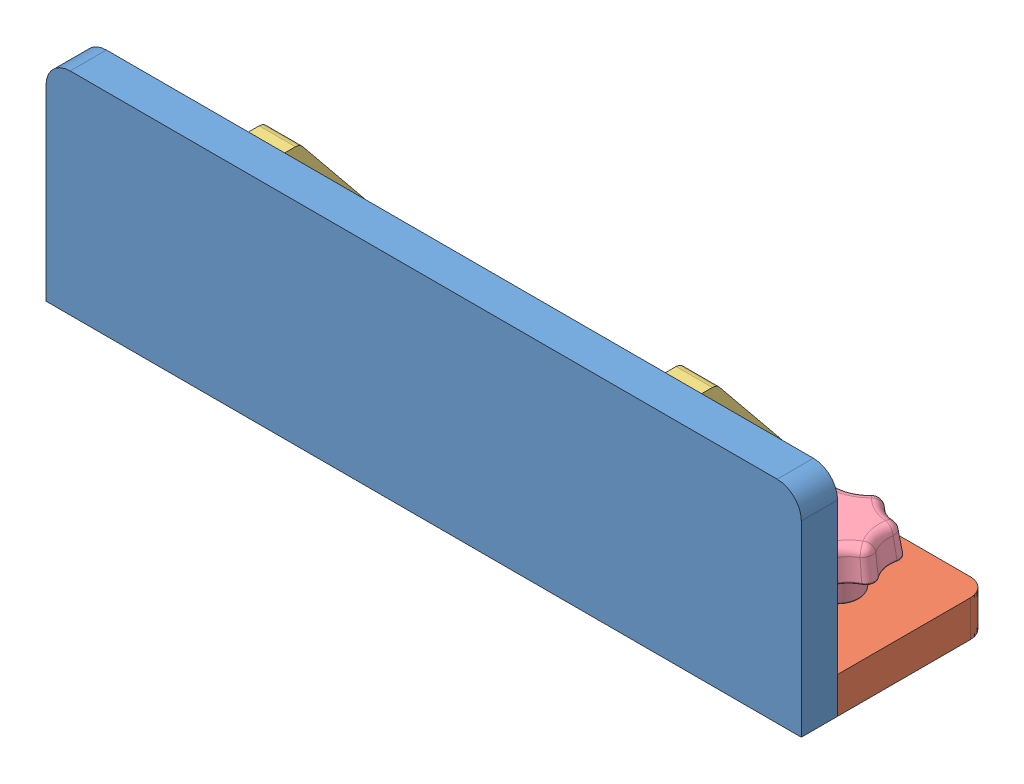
SolidWorks assembly fence.SLDASM, configuration Default (file format 7000). Lengths in mm.
Overall size (250 79 62).
6 component instances, 4 part files, 13 mates.
Components (placement in the parent):
- fence-1: fence.SLDPRT [Default] at origin size (250 70 12)
- onderkant fence-1: onderkant fence.SLDPRT [Default] at (250 0 0) x (0 0 -1) z (1 0 0) size (50 12 250)
- fence support-1: fence support.SLDPRT [Default] at (50 12 0) size (12 53 45)
- fence support-2: fence support.SLDPRT [Default] at (188 12 0) size (12 53 45)
- Screw_Knob-1: Screw_Knob.SLDPRT [Default] at (25 22 -25) x (1 0 0) z (0 1 0) size (30.52 29.78 41)
- Screw_Knob-2: Screw_Knob.SLDPRT [Default] at (225 22 -25) x (1 0 0) z (0 1 0) size (30.52 29.78 41)
Mates (geometry in assembly coordinates):
- Coincident3: coincident anti-aligned: plane of fence-1 through (8 62 0) normal (0 0 -1); plane of onderkant fence-1 through (250 12 0) normal (0 0 1)
- Coincident4: coincident aligned: plane of fence-1 through (0 0 12) normal (0 -1 0); plane of onderkant fence-1 through (250 0 0) normal (0 -1 0)
- Coincident5: coincident aligned: plane of fence-1 through (250 0 12) normal (1 0 0); plane of onderkant fence-1 through (250 12 0) normal (1 0 0)
- Coincident6: coincident anti-aligned: plane of fence-1 through (8 62 0) normal (0 0 -1); plane of fence support-1 through (62 12 0) normal (0 0 1)
- Coincident7: coincident anti-aligned: plane of onderkant fence-1 through (250 12 0) normal (0 1 0); plane of fence support-1 through (62 12 -45) normal (0 -1 0)
- Distance1: distance = 50 mm aligned: plane of fence support-1 through (50 62 -8.5737) normal (-1 0 0); plane of onderkant fence-1 through (0 12 0) normal (-1 0 0)
- Coincident9: coincident anti-aligned: plane of onderkant fence-1 through (250 12 0) normal (0 1 0); plane of fence support-2 through (200 12 -45) normal (0 -1 0)
- Coincident10: coincident anti-aligned: plane of fence-1 through (8 62 0) normal (0 0 -1); plane of fence support-2 through (200 12 0) normal (0 0 1)
- Distance2: distance = 50 mm aligned: plane of fence support-2 through (200 62 -8.5737) normal (1 0 0); plane of onderkant fence-1 through (250 12 0) normal (1 0 0)
- Concentric1: concentric: circle of onderkant fence-1; cylinder of Screw_Knob-1 through (25 -9 -25) axis (0 1 0) radius 3
- Coincident12: coincident aligned: plane of onderkant fence-1 through (250 12 0) normal (0 1 0); circle of Screw_Knob-1
- Concentric2: concentric: cylinder of onderkant fence-1 through (225 0 -25) axis (0 1 0) radius 3.25; cylinder of Screw_Knob-2 through (225 -9 -25) axis (0 1 0) radius 3
- Coincident13: coincident anti-aligned: plane of onderkant fence-1 through (250 12 0) normal (0 1 0); circle of Screw_Knob-2
